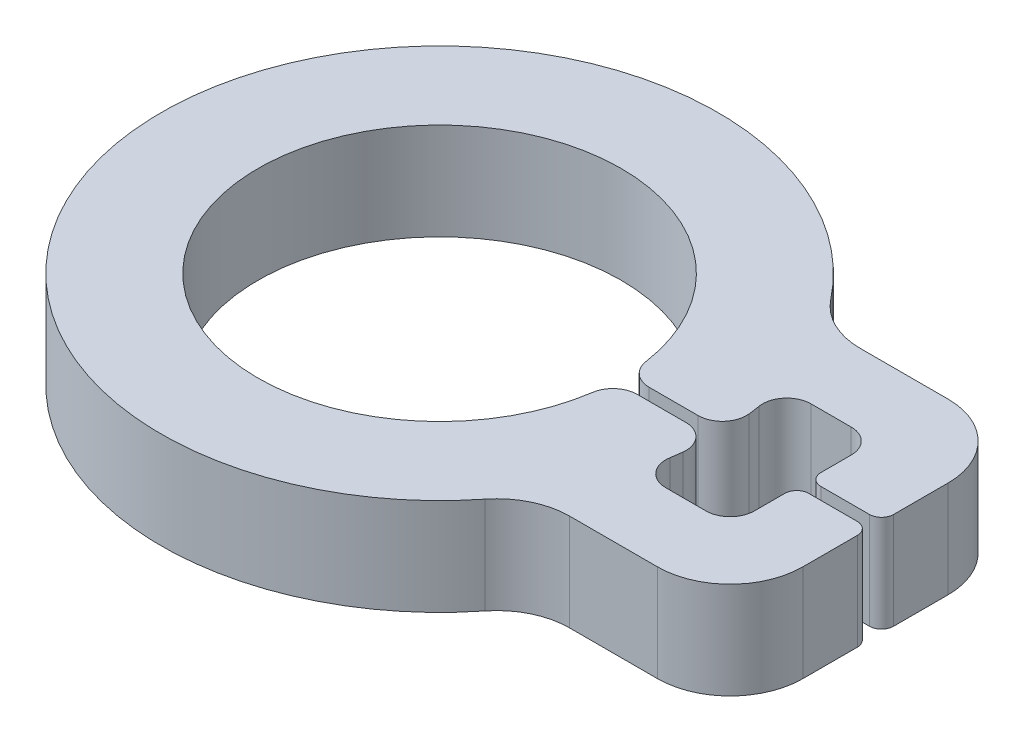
from build123d import *

# Parameters (mm, degrees)
BOSS_EXTRUDE1_DEPTH = 4
FILLET1_R           = 1
FILLET2_R           = 1
FILLET3_R           = 0.5
FILLET4_R           = 3


with BuildPart() as part:
    # Sketch1 → Boss-Extrude1 (new body)
    with BuildSketch(Plane(origin=(0, 0, 0), x_dir=(1, 0, 0), z_dir=(0, 1, 0))):
        with BuildLine():
            Line((9.810708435, 6), (18, 6))
            Line((18, 6), (18, 0.25))
            Line((18, 0.25), (15, 0.25))
            Line((15, 0.25), (15, 3))
            Line((15, 3), (11.101801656, 3))
            ThreePointArc((11.101801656, 3), (11.38289391, 1.636986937), (11.497282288, 0.25))
            Line((11.497282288, 0.25), (7.495832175, 0.25))
            ThreePointArc((7.495832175, 0.25), (-7.5, 0), (7.495832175, -0.25))
            Line((7.495832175, -0.25), (11.497282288, -0.25))
            ThreePointArc((11.497282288, -0.25), (11.38289391, -1.636986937), (11.101801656, -3))
            Line((11.101801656, -3), (15, -3))
            Line((15, -3), (15, -0.25))
            Line((15, -0.25), (18, -0.25))
            Line((18, -0.25), (18, -6))
            Line((18, -6), (9.810708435, -6))
            ThreePointArc((9.810708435, -6), (-11.5, 0), (9.810708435, 6))
        make_face()
    extrude(amount=BOSS_EXTRUDE1_DEPTH)

    # Fillet1
    fillet1_edges = [part.edges().sort_by_distance(p)[0] for p in [
        (11.497282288, 2, -0.25),
        (7.495832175, 2, -0.25),
        (7.495832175, 2, 0.25),
        (11.497282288, 2, 0.25),
    ]]
    fillet(fillet1_edges, radius=FILLET1_R)

    # Fillet2
    fillet2_edges = [part.edges().sort_by_distance(p)[0] for p in [
        (15, 2, -3),
        (11.101801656, 2, -3),
        (11.101801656, 2, 3),
        (15, 2, 3),
    ]]
    fillet(fillet2_edges, radius=FILLET2_R)

    # Fillet3
    fillet3_edges = [part.edges().sort_by_distance(p)[0] for p in [
        (18, 2, -0.25),
        (15, 2, -0.25),
        (15, 2, 0.25),
        (18, 2, 0.25),
    ]]
    fillet(fillet3_edges, radius=FILLET3_R)

    # Fillet4
    fillet4_edges = [part.edges().sort_by_distance(p)[0] for p in [
        (9.810708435, 2, -6),
        (18, 2, -6),
        (18, 2, 6),
        (9.810708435, 2, 6),
    ]]
    fillet(fillet4_edges, radius=FILLET4_R)


solid = part.part
